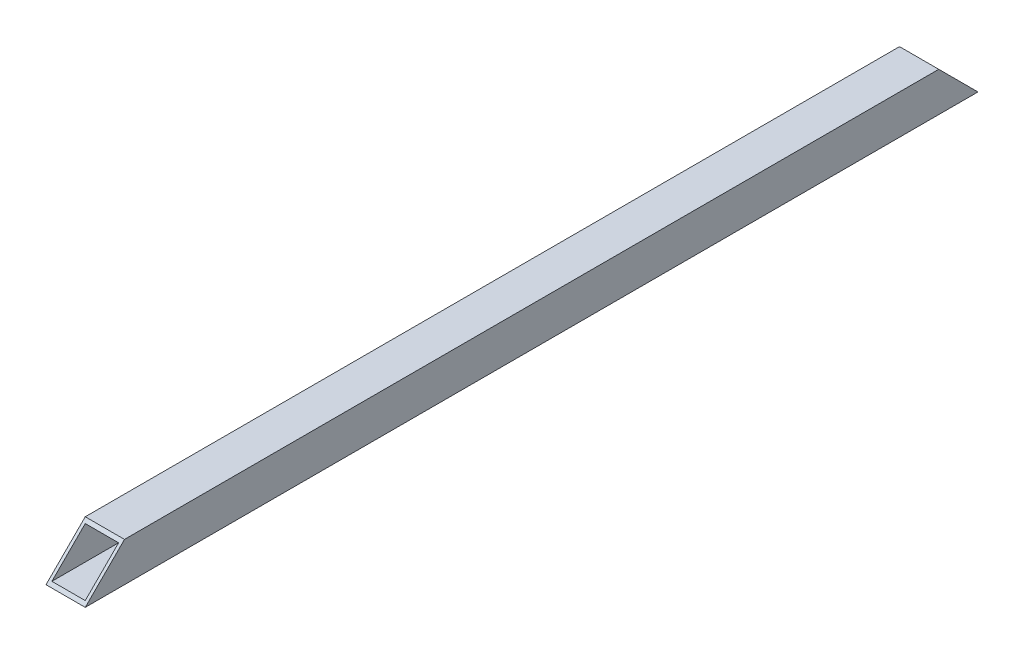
ISO-10303-21;
HEADER;
FILE_DESCRIPTION(('STEP AP214'),'2;1');
FILE_NAME('part.step','',(''),(''),'','','');
FILE_SCHEMA(('AUTOMOTIVE_DESIGN { 1 0 10303 214 1 1 1 1 }'));
ENDSEC;
DATA;
#1=APPLICATION_CONTEXT('core data for automotive mechanical design processes');
#2=APPLICATION_PROTOCOL_DEFINITION('international standard','automotive_design',2000,#1);
#3=PRODUCT_CONTEXT('',#1,'mechanical');
#4=PRODUCT('Part','Part','',(#3));
#5=PRODUCT_RELATED_PRODUCT_CATEGORY('part','',(#4));
#6=PRODUCT_DEFINITION_FORMATION('','',#4);
#7=PRODUCT_DEFINITION_CONTEXT('part definition',#1,'design');
#8=PRODUCT_DEFINITION('design','',#6,#7);
#9=PRODUCT_DEFINITION_SHAPE('','',#8);
#10=(LENGTH_UNIT() NAMED_UNIT(*) SI_UNIT(.MILLI.,.METRE.));
#11=(NAMED_UNIT(*) PLANE_ANGLE_UNIT() SI_UNIT($,.RADIAN.));
#12=(NAMED_UNIT(*) SI_UNIT($,.STERADIAN.) SOLID_ANGLE_UNIT());
#13=UNCERTAINTY_MEASURE_WITH_UNIT(LENGTH_MEASURE(1.E-05),#10,'distance_accuracy_value','');
#14=(GEOMETRIC_REPRESENTATION_CONTEXT(3) GLOBAL_UNCERTAINTY_ASSIGNED_CONTEXT((#13)) GLOBAL_UNIT_ASSIGNED_CONTEXT((#10,
#11,#12)) REPRESENTATION_CONTEXT('',''));
#15=CARTESIAN_POINT('',(0.,0.,0.));
#16=DIRECTION('',(0.,0.,1.));
#17=DIRECTION('',(1.,0.,0.));
#18=AXIS2_PLACEMENT_3D('',#15,#16,#17);
#19=CARTESIAN_POINT('',(0.,0.,910.));
#20=DIRECTION('',(1.,0.,0.));
#21=DIRECTION('',(0.,1.,0.));
#22=AXIS2_PLACEMENT_3D('',#19,#20,#21);
#23=PLANE('',#22);
#24=DIRECTION('',(0.,0.,-1.));
#25=VECTOR('',#24,1.);
#26=CARTESIAN_POINT('',(0.,40.,910.));
#27=LINE('',#26,#25);
#28=CARTESIAN_POINT('',(0.,40.,870.));
#29=VERTEX_POINT('',#28);
#30=CARTESIAN_POINT('',(0.,40.,40.0000000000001));
#31=VERTEX_POINT('',#30);
#32=EDGE_CURVE('E131',#29,#31,#27,.T.);
#33=ORIENTED_EDGE('',*,*,#32,.T.);
#34=DIRECTION('',(0.,-0.707106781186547,-0.707106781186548));
#35=VECTOR('',#34,1.);
#36=CARTESIAN_POINT('',(0.,40.,40.0000000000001));
#37=LINE('',#36,#35);
#38=CARTESIAN_POINT('',(0.,0.,0.));
#39=VERTEX_POINT('',#38);
#40=EDGE_CURVE('E42',#31,#39,#37,.T.);
#41=ORIENTED_EDGE('',*,*,#40,.T.);
#42=DIRECTION('',(0.,0.,-1.));
#43=VECTOR('',#42,1.);
#44=CARTESIAN_POINT('',(0.,0.,910.));
#45=LINE('',#44,#43);
#46=CARTESIAN_POINT('',(0.,0.,910.));
#47=VERTEX_POINT('',#46);
#48=EDGE_CURVE('E124',#47,#39,#45,.T.);
#49=ORIENTED_EDGE('',*,*,#48,.F.);
#50=DIRECTION('',(0.,-0.707106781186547,0.707106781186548));
#51=VECTOR('',#50,1.);
#52=CARTESIAN_POINT('',(0.,-2.35922392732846E-13,910.));
#53=LINE('',#52,#51);
#54=EDGE_CURVE('E121',#47,#29,#53,.F.);
#55=ORIENTED_EDGE('',*,*,#54,.T.);
#56=EDGE_LOOP('',(#33,#41,#49,#55));
#57=FACE_BOUND('',#56,.T.);
#58=ADVANCED_FACE('F32',(#57),#23,.F.);
#59=CARTESIAN_POINT('',(0.,0.,910.));
#60=DIRECTION('',(0.,1.,0.));
#61=DIRECTION('',(0.,0.,1.));
#62=AXIS2_PLACEMENT_3D('',#59,#60,#61);
#63=PLANE('',#62);
#64=DIRECTION('',(1.,0.,0.));
#65=VECTOR('',#64,1.);
#66=CARTESIAN_POINT('',(0.,0.,0.));
#67=LINE('',#66,#65);
#68=CARTESIAN_POINT('',(40.,0.,0.));
#69=VERTEX_POINT('',#68);
#70=EDGE_CURVE('E88',#39,#69,#67,.T.);
#71=ORIENTED_EDGE('',*,*,#70,.T.);
#72=DIRECTION('',(0.,0.,-1.));
#73=VECTOR('',#72,1.);
#74=CARTESIAN_POINT('',(40.,0.,910.));
#75=LINE('',#74,#73);
#76=CARTESIAN_POINT('',(40.,0.,910.));
#77=VERTEX_POINT('',#76);
#78=EDGE_CURVE('E127',#77,#69,#75,.T.);
#79=ORIENTED_EDGE('',*,*,#78,.F.);
#80=DIRECTION('',(1.,0.,0.));
#81=VECTOR('',#80,1.);
#82=CARTESIAN_POINT('',(0.,0.,910.));
#83=LINE('',#82,#81);
#84=EDGE_CURVE('E134',#47,#77,#83,.T.);
#85=ORIENTED_EDGE('',*,*,#84,.F.);
#86=ORIENTED_EDGE('',*,*,#48,.T.);
#87=EDGE_LOOP('',(#71,#79,#85,#86));
#88=FACE_BOUND('',#87,.T.);
#89=ADVANCED_FACE('F173',(#88),#63,.F.);
#90=CARTESIAN_POINT('',(40.,0.,910.));
#91=DIRECTION('',(-1.,0.,0.));
#92=DIRECTION('',(0.,-1.,0.));
#93=AXIS2_PLACEMENT_3D('',#90,#91,#92);
#94=PLANE('',#93);
#95=ORIENTED_EDGE('',*,*,#78,.T.);
#96=DIRECTION('',(0.,0.707106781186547,0.707106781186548));
#97=VECTOR('',#96,1.);
#98=CARTESIAN_POINT('',(40.,40.,40.0000000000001));
#99=LINE('',#98,#97);
#100=CARTESIAN_POINT('',(40.,40.,40.0000000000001));
#101=VERTEX_POINT('',#100);
#102=EDGE_CURVE('E11',#69,#101,#99,.T.);
#103=ORIENTED_EDGE('',*,*,#102,.T.);
#104=DIRECTION('',(0.,0.,-1.));
#105=VECTOR('',#104,1.);
#106=CARTESIAN_POINT('',(40.,40.,910.));
#107=LINE('',#106,#105);
#108=CARTESIAN_POINT('',(40.,40.,870.));
#109=VERTEX_POINT('',#108);
#110=EDGE_CURVE('E129',#109,#101,#107,.T.);
#111=ORIENTED_EDGE('',*,*,#110,.F.);
#112=DIRECTION('',(0.,0.707106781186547,-0.707106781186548));
#113=VECTOR('',#112,1.);
#114=CARTESIAN_POINT('',(40.,-2.39391839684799E-13,910.));
#115=LINE('',#114,#113);
#116=EDGE_CURVE('E107',#109,#77,#115,.F.);
#117=ORIENTED_EDGE('',*,*,#116,.T.);
#118=EDGE_LOOP('',(#95,#103,#111,#117));
#119=FACE_BOUND('',#118,.T.);
#120=ADVANCED_FACE('F179',(#119),#94,.F.);
#121=CARTESIAN_POINT('',(0.,40.,910.));
#122=DIRECTION('',(0.,-1.,0.));
#123=DIRECTION('',(0.,0.,-1.));
#124=AXIS2_PLACEMENT_3D('',#121,#122,#123);
#125=PLANE('',#124);
#126=ORIENTED_EDGE('',*,*,#110,.T.);
#127=DIRECTION('',(-1.,0.,0.));
#128=VECTOR('',#127,1.);
#129=CARTESIAN_POINT('',(0.,40.,40.0000000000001));
#130=LINE('',#129,#128);
#131=EDGE_CURVE('E104',#101,#31,#130,.T.);
#132=ORIENTED_EDGE('',*,*,#131,.T.);
#133=ORIENTED_EDGE('',*,*,#32,.F.);
#134=DIRECTION('',(1.,0.,0.));
#135=VECTOR('',#134,1.);
#136=CARTESIAN_POINT('',(0.,40.,870.));
#137=LINE('',#136,#135);
#138=EDGE_CURVE('E118',#29,#109,#137,.T.);
#139=ORIENTED_EDGE('',*,*,#138,.T.);
#140=EDGE_LOOP('',(#126,#132,#133,#139));
#141=FACE_BOUND('',#140,.T.);
#142=ADVANCED_FACE('F176',(#141),#125,.F.);
#143=CARTESIAN_POINT('',(2.99999999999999,37.,910.));
#144=DIRECTION('',(1.,0.,0.));
#145=DIRECTION('',(0.,1.,0.));
#146=AXIS2_PLACEMENT_3D('',#143,#144,#145);
#147=PLANE('',#146);
#148=DIRECTION('',(0.,-0.707106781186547,-0.707106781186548));
#149=VECTOR('',#148,1.);
#150=CARTESIAN_POINT('',(2.99999999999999,40.,40.0000000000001));
#151=LINE('',#150,#149);
#152=CARTESIAN_POINT('',(2.99999999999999,37.,37.0000000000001));
#153=VERTEX_POINT('',#152);
#154=CARTESIAN_POINT('',(3.,3.,3.));
#155=VERTEX_POINT('',#154);
#156=EDGE_CURVE('E36',#153,#155,#151,.T.);
#157=ORIENTED_EDGE('',*,*,#156,.F.);
#158=DIRECTION('',(0.,0.,-1.));
#159=VECTOR('',#158,1.);
#160=CARTESIAN_POINT('',(2.99999999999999,37.,910.));
#161=LINE('',#160,#159);
#162=CARTESIAN_POINT('',(2.99999999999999,37.,873.));
#163=VERTEX_POINT('',#162);
#164=EDGE_CURVE('E111',#163,#153,#161,.T.);
#165=ORIENTED_EDGE('',*,*,#164,.F.);
#166=DIRECTION('',(0.,0.707106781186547,-0.707106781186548));
#167=VECTOR('',#166,1.);
#168=CARTESIAN_POINT('',(2.99999999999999,18.4999999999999,891.5));
#169=LINE('',#168,#167);
#170=CARTESIAN_POINT('',(3.,3.,907.));
#171=VERTEX_POINT('',#170);
#172=EDGE_CURVE('E87',#163,#171,#169,.F.);
#173=ORIENTED_EDGE('',*,*,#172,.T.);
#174=DIRECTION('',(0.,0.,-1.));
#175=VECTOR('',#174,1.);
#176=CARTESIAN_POINT('',(3.,3.,910.));
#177=LINE('',#176,#175);
#178=EDGE_CURVE('E71',#171,#155,#177,.T.);
#179=ORIENTED_EDGE('',*,*,#178,.T.);
#180=EDGE_LOOP('',(#157,#165,#173,#179));
#181=FACE_BOUND('',#180,.T.);
#182=ADVANCED_FACE('F83',(#181),#147,.T.);
#183=CARTESIAN_POINT('',(3.,3.,910.));
#184=DIRECTION('',(0.,1.,0.));
#185=DIRECTION('',(0.,0.,1.));
#186=AXIS2_PLACEMENT_3D('',#183,#184,#185);
#187=PLANE('',#186);
#188=DIRECTION('',(1.,0.,0.));
#189=VECTOR('',#188,1.);
#190=CARTESIAN_POINT('',(0.,3.,3.00000000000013));
#191=LINE('',#190,#189);
#192=CARTESIAN_POINT('',(37.,3.,3.));
#193=VERTEX_POINT('',#192);
#194=EDGE_CURVE('E67',#155,#193,#191,.T.);
#195=ORIENTED_EDGE('',*,*,#194,.F.);
#196=ORIENTED_EDGE('',*,*,#178,.F.);
#197=DIRECTION('',(-1.,0.,0.));
#198=VECTOR('',#197,1.);
#199=CARTESIAN_POINT('',(3.,3.,907.));
#200=LINE('',#199,#198);
#201=CARTESIAN_POINT('',(37.,3.,907.));
#202=VERTEX_POINT('',#201);
#203=EDGE_CURVE('E98',#171,#202,#200,.F.);
#204=ORIENTED_EDGE('',*,*,#203,.T.);
#205=DIRECTION('',(0.,0.,-1.));
#206=VECTOR('',#205,1.);
#207=CARTESIAN_POINT('',(37.,3.,910.));
#208=LINE('',#207,#206);
#209=EDGE_CURVE('E74',#202,#193,#208,.T.);
#210=ORIENTED_EDGE('',*,*,#209,.T.);
#211=EDGE_LOOP('',(#195,#196,#204,#210));
#212=FACE_BOUND('',#211,.T.);
#213=ADVANCED_FACE('F69',(#212),#187,.T.);
#214=CARTESIAN_POINT('',(37.,37.,910.));
#215=DIRECTION('',(-1.,0.,0.));
#216=DIRECTION('',(0.,0.,1.));
#217=AXIS2_PLACEMENT_3D('',#214,#215,#216);
#218=PLANE('',#217);
#219=DIRECTION('',(0.,0.707106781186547,0.707106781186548));
#220=VECTOR('',#219,1.);
#221=CARTESIAN_POINT('',(37.,40.,40.0000000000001));
#222=LINE('',#221,#220);
#223=CARTESIAN_POINT('',(37.,37.,37.0000000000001));
#224=VERTEX_POINT('',#223);
#225=EDGE_CURVE('E79',#193,#224,#222,.T.);
#226=ORIENTED_EDGE('',*,*,#225,.F.);
#227=ORIENTED_EDGE('',*,*,#209,.F.);
#228=DIRECTION('',(0.,-0.707106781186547,0.707106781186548));
#229=VECTOR('',#228,1.);
#230=CARTESIAN_POINT('',(37.,18.4999999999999,891.5));
#231=LINE('',#230,#229);
#232=CARTESIAN_POINT('',(37.,37.,873.));
#233=VERTEX_POINT('',#232);
#234=EDGE_CURVE('E112',#202,#233,#231,.F.);
#235=ORIENTED_EDGE('',*,*,#234,.T.);
#236=DIRECTION('',(0.,0.,-1.));
#237=VECTOR('',#236,1.);
#238=CARTESIAN_POINT('',(37.,37.,910.));
#239=LINE('',#238,#237);
#240=EDGE_CURVE('E140',#233,#224,#239,.T.);
#241=ORIENTED_EDGE('',*,*,#240,.T.);
#242=EDGE_LOOP('',(#226,#227,#235,#241));
#243=FACE_BOUND('',#242,.T.);
#244=ADVANCED_FACE('F153',(#243),#218,.T.);
#245=CARTESIAN_POINT('',(2.99999999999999,37.,910.));
#246=DIRECTION('',(0.,-1.,0.));
#247=DIRECTION('',(0.,0.,-1.));
#248=AXIS2_PLACEMENT_3D('',#245,#246,#247);
#249=PLANE('',#248);
#250=DIRECTION('',(-1.,0.,0.));
#251=VECTOR('',#250,1.);
#252=CARTESIAN_POINT('',(0.,37.,37.0000000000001));
#253=LINE('',#252,#251);
#254=EDGE_CURVE('E92',#224,#153,#253,.T.);
#255=ORIENTED_EDGE('',*,*,#254,.F.);
#256=ORIENTED_EDGE('',*,*,#240,.F.);
#257=DIRECTION('',(1.,0.,0.));
#258=VECTOR('',#257,1.);
#259=CARTESIAN_POINT('',(2.99999999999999,37.,873.));
#260=LINE('',#259,#258);
#261=EDGE_CURVE('E108',#233,#163,#260,.F.);
#262=ORIENTED_EDGE('',*,*,#261,.T.);
#263=ORIENTED_EDGE('',*,*,#164,.T.);
#264=EDGE_LOOP('',(#255,#256,#262,#263));
#265=FACE_BOUND('',#264,.T.);
#266=ADVANCED_FACE('F142',(#265),#249,.T.);
#267=CARTESIAN_POINT('',(0.,-2.35922392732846E-13,910.));
#268=DIRECTION('',(0.,-0.707106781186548,-0.707106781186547));
#269=DIRECTION('',(0.,0.707106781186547,-0.707106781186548));
#270=AXIS2_PLACEMENT_3D('',#267,#268,#269);
#271=PLANE('',#270);
#272=ORIENTED_EDGE('',*,*,#116,.F.);
#273=ORIENTED_EDGE('',*,*,#138,.F.);
#274=ORIENTED_EDGE('',*,*,#54,.F.);
#275=ORIENTED_EDGE('',*,*,#84,.T.);
#276=EDGE_LOOP('',(#272,#273,#274,#275));
#277=FACE_BOUND('',#276,.T.);
#278=ORIENTED_EDGE('',*,*,#172,.F.);
#279=ORIENTED_EDGE('',*,*,#261,.F.);
#280=ORIENTED_EDGE('',*,*,#234,.F.);
#281=ORIENTED_EDGE('',*,*,#203,.F.);
#282=EDGE_LOOP('',(#278,#279,#280,#281));
#283=FACE_BOUND('',#282,.T.);
#284=ADVANCED_FACE('F148',(#277,#283),#271,.F.);
#285=CARTESIAN_POINT('',(0.,40.,40.0000000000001));
#286=DIRECTION('',(0.,0.707106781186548,-0.707106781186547));
#287=DIRECTION('',(0.,0.707106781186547,0.707106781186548));
#288=AXIS2_PLACEMENT_3D('',#285,#286,#287);
#289=PLANE('',#288);
#290=ORIENTED_EDGE('',*,*,#102,.F.);
#291=ORIENTED_EDGE('',*,*,#70,.F.);
#292=ORIENTED_EDGE('',*,*,#40,.F.);
#293=ORIENTED_EDGE('',*,*,#131,.F.);
#294=EDGE_LOOP('',(#290,#291,#292,#293));
#295=FACE_BOUND('',#294,.T.);
#296=ORIENTED_EDGE('',*,*,#254,.T.);
#297=ORIENTED_EDGE('',*,*,#156,.T.);
#298=ORIENTED_EDGE('',*,*,#194,.T.);
#299=ORIENTED_EDGE('',*,*,#225,.T.);
#300=EDGE_LOOP('',(#296,#297,#298,#299));
#301=FACE_BOUND('',#300,.T.);
#302=ADVANCED_FACE('F34',(#295,#301),#289,.T.);
#303=CLOSED_SHELL('',(#58,#89,#120,#142,#182,#213,#244,#266,#284,#302));
#304=MANIFOLD_SOLID_BREP('B2',#303);
#305=ADVANCED_BREP_SHAPE_REPRESENTATION('',(#18,#304),#14);
#306=SHAPE_DEFINITION_REPRESENTATION(#9,#305);
ENDSEC;
END-ISO-10303-21;
